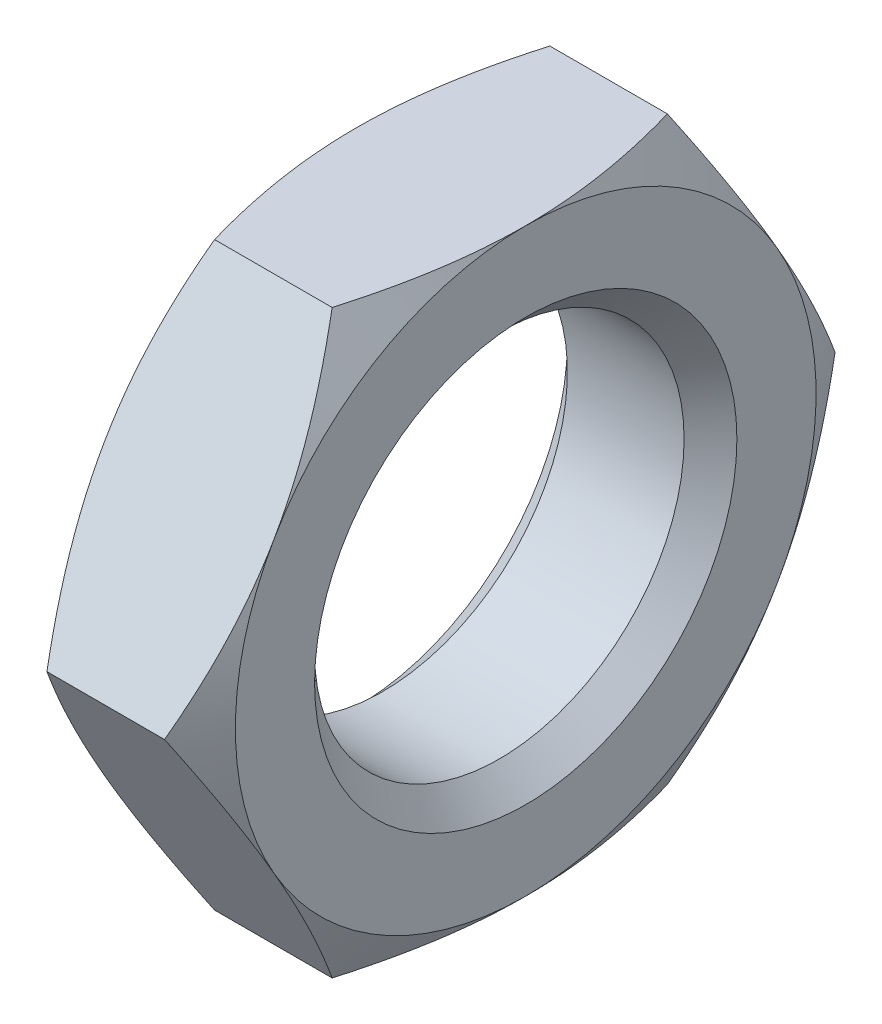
from build123d import *

# Parameters (mm, degrees)
SKETCH1_R      = 7
EXTRUDE1_DEPTH = 6.42
CHAMFER1_SIZE  = 1


with BuildPart() as part:
    # Sketch1 → Extrude1 (new body)
    with BuildSketch(Plane(origin=(0, 0, 0), x_dir=(0, 0, -1), z_dir=(1, 0, 0))):
        Polygon((6.350852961, 11), (-6.350852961, 11), (-12.701705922, 0), (-6.350852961, -11), (6.350852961, -11), (12.701705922, 0), align=None)
        with Locations(Location((0, 0, 0), (0, 0, 180))):
            Circle(SKETCH1_R, mode=Mode.SUBTRACT)
    extrude(amount=EXTRUDE1_DEPTH)

    # Sketch2 → Cut-Revolve1 (revolve, cut)
    with BuildSketch(Plane.XY):
        Polygon((6.42, 11), (6.42, 44), (0, 44), (0, 11), (3.21, 16.559883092), align=None)
    revolve(axis=Axis((6.42, 0, 0), (-1, 0, 0)), mode=Mode.SUBTRACT)

    # Chamfer1
    chamfer1_edges = [part.edges().sort_by_distance(p)[0] for p in [
        (0, 0, -7),
        (6.42, 0, -7),
    ]]
    chamfer(chamfer1_edges, length=CHAMFER1_SIZE)


solid = part.part
